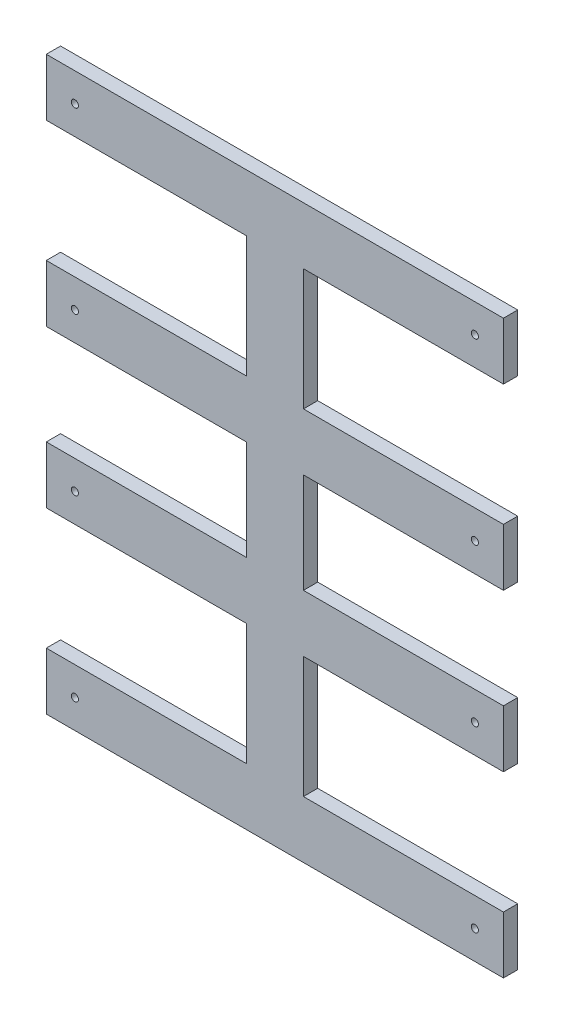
from build123d import *

# Parameters (mm, degrees)
SKETCH_1_R      = 1.5875
EXTRUDE_1_DEPTH = 6.35


with BuildPart() as part:
    # Sketch 1 → Extrude 1 (new body)
    with BuildSketch(Plane.XY):
        Polygon((-12.7, 101.6), (-101.6, 101.6), (-101.6, 127), (101.6, 127), (101.6, 101.6), (12.7, 101.6), (12.7, 47.625), (101.6, 47.625), (101.6, 22.225), (12.7, 22.225), (12.7, -22.225), (101.6, -22.225), (101.6, -47.625), (12.7, -47.625), (12.7, -101.6), (101.6, -101.6), (101.6, -127), (-101.6, -127), (-101.6, -101.6), (-12.7, -101.6), (-12.7, -47.625), (-101.6, -47.625), (-101.6, -22.225), (-12.7, -22.225), (-12.7, 22.225), (-101.6, 22.225), (-101.6, 47.625), (-12.7, 47.625), align=None)
        with Locations((-88.9, 114.3)):
            Circle(SKETCH_1_R, mode=Mode.SUBTRACT)
        with Locations((88.9, 114.3)):
            Circle(SKETCH_1_R, mode=Mode.SUBTRACT)
        with Locations((88.9, 34.925)):
            Circle(SKETCH_1_R, mode=Mode.SUBTRACT)
        with Locations((-88.9, 34.925)):
            Circle(SKETCH_1_R, mode=Mode.SUBTRACT)
        with Locations(Location((-88.9, -34.925, 0), (0, 0, 180))):
            Circle(SKETCH_1_R, mode=Mode.SUBTRACT)
        with Locations(Location((88.9, -34.925, 0), (0, 0, 180))):
            Circle(SKETCH_1_R, mode=Mode.SUBTRACT)
        with Locations(Location((88.9, -114.3, 0), (0, 0, 180))):
            Circle(SKETCH_1_R, mode=Mode.SUBTRACT)
        with Locations(Location((-88.9, -114.3, 0), (0, 0, 180))):
            Circle(SKETCH_1_R, mode=Mode.SUBTRACT)
    extrude(amount=EXTRUDE_1_DEPTH)


solid = part.part
